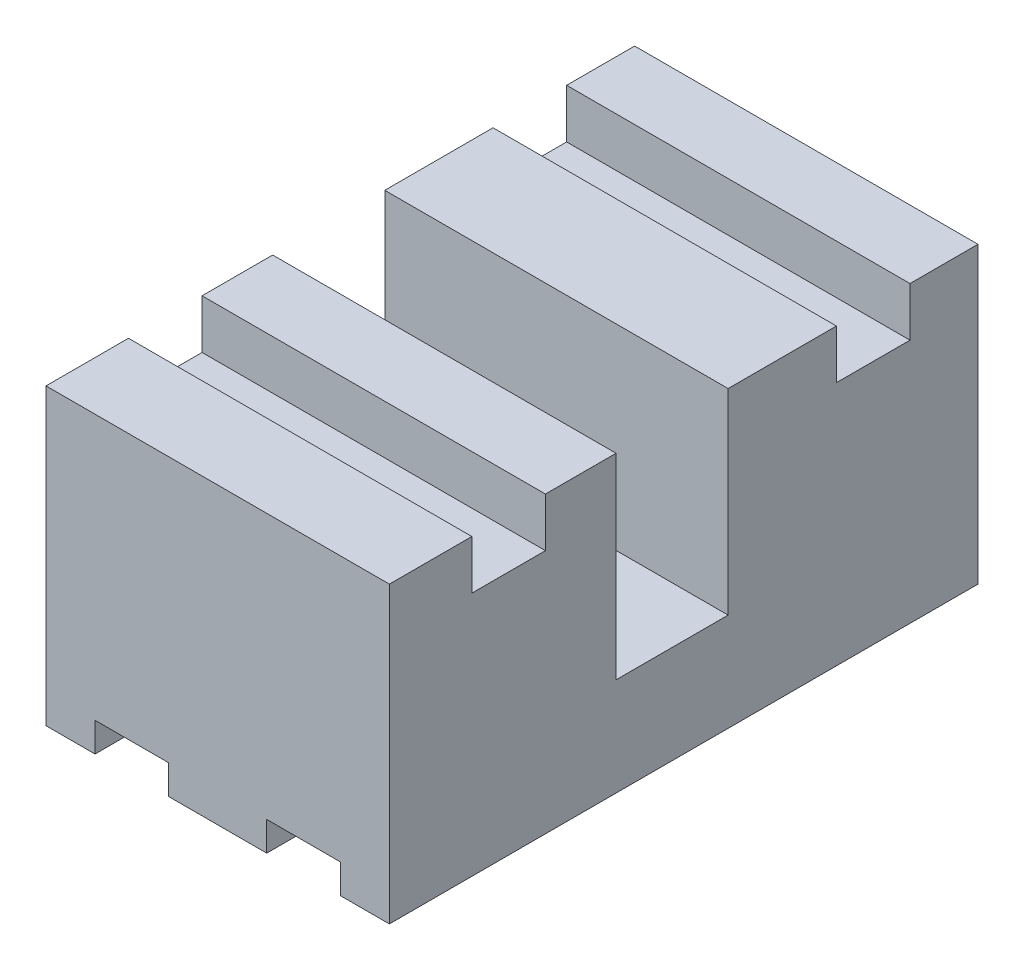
from build123d import *

# Parameters (mm, degrees)
BOSS_EXTRUDE1_DEPTH = 300
BOSS_EXTRUDE2_DEPTH = 175


with BuildPart() as part:
    # Sketch1 → Boss-Extrude1 (new body)
    with BuildSketch(Plane.XY):
        Polygon((0, 50), (0, 0), (25, 0), (25, 14.89943793), (62.5, 14.89943793), (62.5, 0), (112.5, 0), (112.5, 14.89943793), (150, 14.89943793), (150, 0), (175, 0), (175, 50), align=None)
    extrude(amount=BOSS_EXTRUDE1_DEPTH)

    # Sketch2 → Boss-Extrude2 (add)
    with BuildSketch(Plane.ZY):
        Polygon((0, 50), (0, 150), (34.656648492, 150), (34.656648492, 125), (72.156648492, 125), (72.156648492, 150), (127.352675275, 150), (127.352675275, 50), align=None)
        Polygon((300, 50), (300, 150), (257.965859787, 150), (257.965859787, 125), (220.465859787, 125), (220.465859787, 150), (184.471740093, 150), (184.471740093, 50), align=None)
    extrude(amount=-BOSS_EXTRUDE2_DEPTH)


solid = part.part
